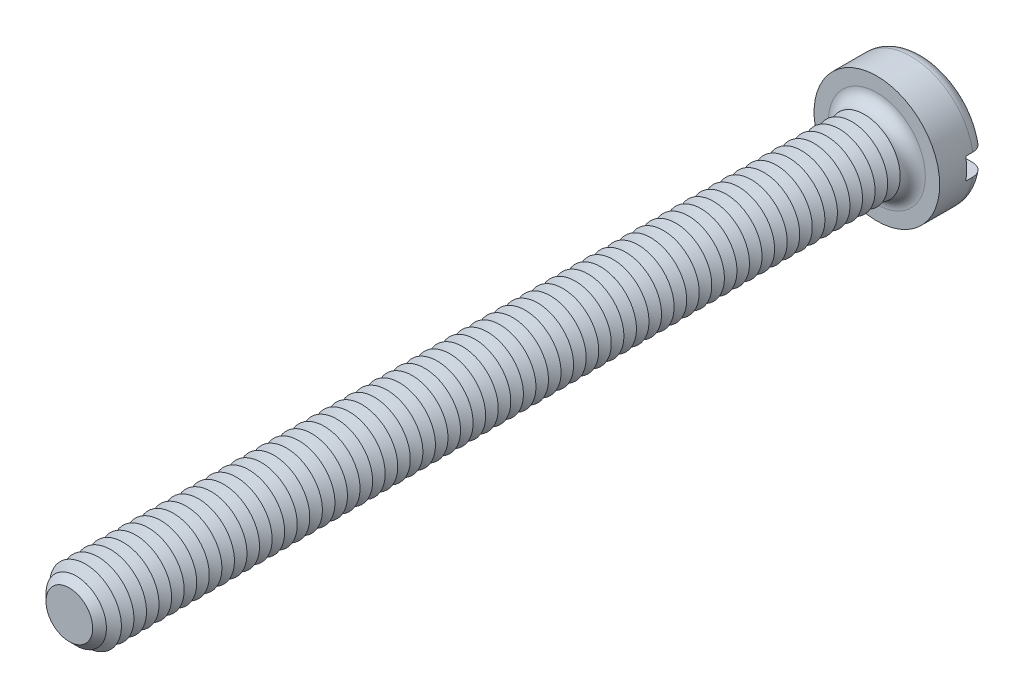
from build123d import *

# Parameters (mm, degrees)
SKETCH3_R           = 3.5
BOSS_EXTRUDE2_DEPTH = 2.6
SKETCH4_R           = 2
BOSS_EXTRUDE3_DEPTH = 45
FILLET1_R           = 0.7
CHAMFER1_SIZE       = 0.7
LPATTERN1_COUNT     = 63
LPATTERN1_PITCH     = 0.7
SKETCH8_W           = 7
SKETCH8_H           = 1.2
CUT_EXTRUDE1_DEPTH  = 1.1


with BuildPart() as part:
    # Sketch3 → Boss-Extrude2 (new body)
    with BuildSketch(Plane.XY):
        Circle(SKETCH3_R)
    extrude(amount=-BOSS_EXTRUDE2_DEPTH)

    # Sketch4 → Boss-Extrude3 (add)
    with BuildSketch(Plane.XY):
        with Locations(Location((0, 0, 0), (0, 0, 180))):
            Circle(SKETCH4_R)
    extrude(amount=BOSS_EXTRUDE3_DEPTH)

    # Fillet1
    fillet1_edges = [part.edges().sort_by_distance(p)[0] for p in [
        (-3.5, 0, -2.6),
        (2, 0, 0),
    ]]
    fillet(fillet1_edges, radius=FILLET1_R)

    # Chamfer1
    chamfer1_edges = [part.edges().sort_by_distance(p)[0] for p in [
        (2, 0, 45),
    ]]
    chamfer(chamfer1_edges, length=CHAMFER1_SIZE)

    # Sketch6 → Cut-Revolve1 (revolve, cut)
    with BuildSketch(Plane(origin=(0, 0, 0), x_dir=(0, 0, -1), z_dir=(1, 0, 0)), mode=Mode.PRIVATE) as cut_revolve1_sk:
        Polygon((-0.7, 2), (-1.05, 1.393782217), (-1.4, 2), align=None)
    cut_revolve1 = revolve(cut_revolve1_sk.sketch.rotate(Axis((0, 0, -1.694361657), (0, 0, 1)), 90), axis=Axis((0, 0, -1.694361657), (0, 0, 1)), mode=Mode.SUBTRACT)

    # LPattern1: Cut-Revolve1 ×63
    with Locations(*[(0, 0, i * LPATTERN1_PITCH) for i in range(1, LPATTERN1_COUNT)]):
        add(cut_revolve1, mode=Mode.SUBTRACT)

    # Sketch8 → Cut-Extrude1 (cut)
    with BuildSketch(Plane(origin=(0, 0, -2.6), x_dir=(-1, 0, 0), z_dir=(0, 0, -1))):
        Rectangle(SKETCH8_W, SKETCH8_H)
    extrude(amount=-CUT_EXTRUDE1_DEPTH, mode=Mode.SUBTRACT)


solid = part.part
